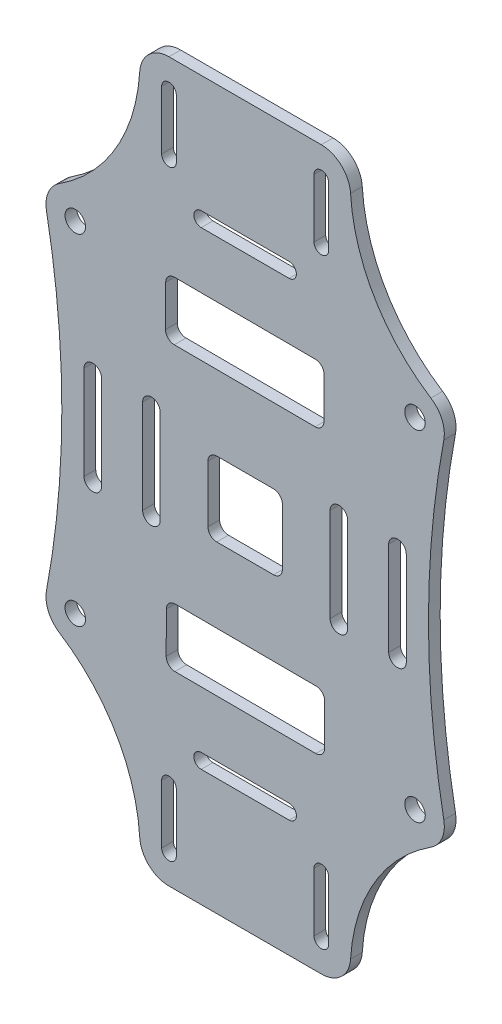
from build123d import *

# Parameters (mm, degrees)
SKETCH5_R           = 1.75
BOSS_EXTRUDE2_DEPTH = 2
FILLET1_R           = 30


with BuildPart() as part:
    # Sketch5 → Boss-Extrude2 (new body)
    with BuildSketch(Plane.XY):
        with BuildLine():
            Line((18, 32.356911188), (18, 56.284600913))
            ThreePointArc((18, 56.284600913), (16.535533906, 59.820134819), (13, 61.284600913))
            Line((13, 61.284600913), (-13, 61.284600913))
            ThreePointArc((-13, 61.284600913), (-16.535533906, 59.820134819), (-18, 56.284600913))
            Line((-18, 56.284600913), (-18, 32.356911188))
            ThreePointArc((-18, 32.356911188), (-23.04590062, 33.046394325), (-28.065797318, 33.904961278))
            ThreePointArc((-28.065797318, 33.904961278), (-32.526911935, 32.526911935), (-33.904961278, 28.065797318))
            ThreePointArc((-33.904961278, 28.065797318), (-31.284600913, 0), (-33.904961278, -28.065797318))
            ThreePointArc((-33.904961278, -28.065797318), (-32.526911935, -32.526911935), (-28.065797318, -33.904961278))
            ThreePointArc((-28.065797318, -33.904961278), (-23.04590062, -33.046394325), (-18, -32.356911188))
            Line((-18, -32.356911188), (-18, -56.284600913))
            ThreePointArc((-18, -56.284600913), (-16.535533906, -59.820134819), (-13, -61.284600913))
            Line((-13, -61.284600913), (13, -61.284600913))
            ThreePointArc((13, -61.284600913), (16.535533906, -59.820134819), (18, -56.284600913))
            Line((18, -56.284600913), (18, -32.356911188))
            ThreePointArc((18, -32.356911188), (23.04590062, -33.046394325), (28.065797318, -33.904961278))
            ThreePointArc((28.065797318, -33.904961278), (32.526911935, -32.526911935), (33.904961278, -28.065797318))
            ThreePointArc((33.904961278, -28.065797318), (31.284600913, 0), (33.904961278, 28.065797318))
            ThreePointArc((33.904961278, 28.065797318), (32.526911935, 32.526911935), (28.065797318, 33.904961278))
            ThreePointArc((28.065797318, 33.904961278), (23.04590062, 33.046394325), (18, 32.356911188))
        make_face()
        with Locations((28.991378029, 28.991378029)):
            Circle(SKETCH5_R, mode=Mode.SUBTRACT)
        with Locations((28.991378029, -28.991378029)):
            Circle(SKETCH5_R, mode=Mode.SUBTRACT)
        with Locations((-28.991378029, -28.991378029)):
            Circle(SKETCH5_R, mode=Mode.SUBTRACT)
        with Locations((-28.991378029, 28.991378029)):
            Circle(SKETCH5_R, mode=Mode.SUBTRACT)
        with BuildLine():
            Line((-14.25, 56.284600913), (-14.25, 46.284600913))
            ThreePointArc((-14.25, 46.284600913), (-13, 45.034600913), (-11.75, 46.284600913))
            Line((-11.75, 46.284600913), (-11.75, 56.284600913))
            ThreePointArc((-11.75, 56.284600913), (-13, 57.534600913), (-14.25, 56.284600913))
        make_face(mode=Mode.SUBTRACT)
        with BuildLine():
            Line((11.75, 56.284600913), (11.75, 46.284600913))
            ThreePointArc((11.75, 46.284600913), (13, 45.034600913), (14.25, 46.284600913))
            Line((14.25, 46.284600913), (14.25, 56.284600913))
            ThreePointArc((14.25, 56.284600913), (13, 57.534600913), (11.75, 56.284600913))
        make_face(mode=Mode.SUBTRACT)
        with BuildLine():
            Line((-14.25, -56.284600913), (-14.25, -46.284600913))
            ThreePointArc((-14.25, -46.284600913), (-13, -45.034600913), (-11.75, -46.284600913))
            Line((-11.75, -46.284600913), (-11.75, -56.284600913))
            ThreePointArc((-11.75, -56.284600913), (-13, -57.534600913), (-14.25, -56.284600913))
        make_face(mode=Mode.SUBTRACT)
        with BuildLine():
            Line((11.75, -56.284600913), (11.75, -46.284600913))
            ThreePointArc((11.75, -46.284600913), (13, -45.034600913), (14.25, -46.284600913))
            Line((14.25, -46.284600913), (14.25, -56.284600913))
            ThreePointArc((14.25, -56.284600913), (13, -57.534600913), (11.75, -56.284600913))
        make_face(mode=Mode.SUBTRACT)
        with BuildLine():
            Line((-12.050711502, 29.171956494), (11.98155257, 29.071015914))
            ThreePointArc((11.98155257, 29.071015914), (13.040358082, 28.627225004), (13.475239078, 27.564728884))
            Line((13.475239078, 27.564728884), (13.44583786, 20.564790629))
            ThreePointArc((13.44583786, 20.564790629), (13.00204695, 19.505985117), (11.939550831, 19.071104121))
            Line((11.939550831, 19.071104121), (-12.092713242, 19.172044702))
            ThreePointArc((-12.092713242, 19.172044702), (-13.151518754, 19.615835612), (-13.58639975, 20.678331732))
            Line((-13.58639975, 20.678331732), (-13.556998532, 27.678269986))
            ThreePointArc((-13.556998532, 27.678269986), (-13.113207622, 28.737075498), (-12.050711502, 29.171956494))
        make_face(mode=Mode.SUBTRACT)
        with BuildLine():
            Line((27.5, 0), (27.5, 8))
            ThreePointArc((27.5, 8), (26, 9.5), (24.5, 8))
            Line((24.5, 8), (24.5, 0))
            Line((24.5, 0), (24.5, -8))
            ThreePointArc((24.5, -8), (26, -9.5), (27.5, -8))
            Line((27.5, -8), (27.5, 0))
        make_face(mode=Mode.SUBTRACT)
        with BuildLine():
            Line((17.5, 0), (17.5, 8))
            ThreePointArc((17.5, 8), (16, 9.5), (14.5, 8))
            Line((14.5, 8), (14.5, 0))
            Line((14.5, 0), (14.5, -8))
            ThreePointArc((14.5, -8), (16, -9.5), (17.5, -8))
            Line((17.5, -8), (17.5, 0))
        make_face(mode=Mode.SUBTRACT)
        with BuildLine():
            Line((-14.5, 0), (-14.5, 8))
            ThreePointArc((-14.5, 8), (-16, 9.5), (-17.5, 8))
            Line((-17.5, 8), (-17.5, 0))
            Line((-17.5, 0), (-17.5, -8))
            ThreePointArc((-17.5, -8), (-16, -9.5), (-14.5, -8))
            Line((-14.5, -8), (-14.5, 0))
        make_face(mode=Mode.SUBTRACT)
        with BuildLine():
            Line((-24.5, 0), (-24.5, 8))
            ThreePointArc((-24.5, 8), (-26, 9.5), (-27.5, 8))
            Line((-27.5, 8), (-27.5, 0))
            Line((-27.5, 0), (-27.5, -8))
            ThreePointArc((-27.5, -8), (-26, -9.5), (-24.5, -8))
            Line((-24.5, -8), (-24.5, 0))
        make_face(mode=Mode.SUBTRACT)
        with BuildLine():
            Line((-11.939550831, -19.071104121), (12.092713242, -19.172044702))
            ThreePointArc((12.092713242, -19.172044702), (13.151518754, -19.615835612), (13.58639975, -20.678331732))
            Line((13.58639975, -20.678331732), (13.556998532, -27.678269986))
            ThreePointArc((13.556998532, -27.678269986), (13.113207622, -28.737075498), (12.050711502, -29.171956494))
            Line((12.050711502, -29.171956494), (-11.98155257, -29.071015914))
            ThreePointArc((-11.98155257, -29.071015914), (-13.040358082, -28.627225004), (-13.475239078, -27.564728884))
            Line((-13.475239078, -27.564728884), (-13.44583786, -20.564790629))
            ThreePointArc((-13.44583786, -20.564790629), (-13.00204695, -19.505985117), (-11.939550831, -19.071104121))
        make_face(mode=Mode.SUBTRACT)
        with BuildLine():
            Line((0, 41.284600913), (7.5, 41.284600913))
            ThreePointArc((7.5, 41.284600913), (8.75, 40.034600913), (7.5, 38.784600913))
            Line((7.5, 38.784600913), (0, 38.784600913))
            Line((0, 38.784600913), (-7.5, 38.784600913))
            ThreePointArc((-7.5, 38.784600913), (-8.75, 40.034600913), (-7.5, 41.284600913))
            Line((-7.5, 41.284600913), (0, 41.284600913))
        make_face(mode=Mode.SUBTRACT)
        with BuildLine():
            Line((0, -38.784600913), (-7.5, -38.784600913))
            ThreePointArc((-7.5, -38.784600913), (-8.75, -40.034600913), (-7.5, -41.284600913))
            Line((-7.5, -41.284600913), (0, -41.284600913))
            Line((0, -41.284600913), (7.5, -41.284600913))
            ThreePointArc((7.5, -41.284600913), (8.75, -40.034600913), (7.5, -38.784600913))
            Line((7.5, -38.784600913), (0, -38.784600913))
        make_face(mode=Mode.SUBTRACT)
        with BuildLine():
            Line((-4.85, 6.35), (4.85, 6.35))
            ThreePointArc((4.85, 6.35), (5.910660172, 5.910660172), (6.35, 4.85))
            Line((6.35, 4.85), (6.35, -4.85))
            ThreePointArc((6.35, -4.85), (5.910660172, -5.910660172), (4.85, -6.35))
            Line((4.85, -6.35), (-4.85, -6.35))
            ThreePointArc((-4.85, -6.35), (-5.910660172, -5.910660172), (-6.35, -4.85))
            Line((-6.35, -4.85), (-6.35, 4.85))
            ThreePointArc((-6.35, 4.85), (-5.910660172, 5.910660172), (-4.85, 6.35))
        make_face(mode=Mode.SUBTRACT)
    extrude(amount=BOSS_EXTRUDE2_DEPTH)

    # Fillet1
    fillet1_edges = [part.edges().sort_by_distance(p)[0] for p in [
        (18, -32.356911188, 1),
        (-18, -32.356911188, 1),
        (-18, 32.356911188, 1),
        (18, 32.356911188, 1),
    ]]
    fillet(fillet1_edges, radius=FILLET1_R)


solid = part.part
